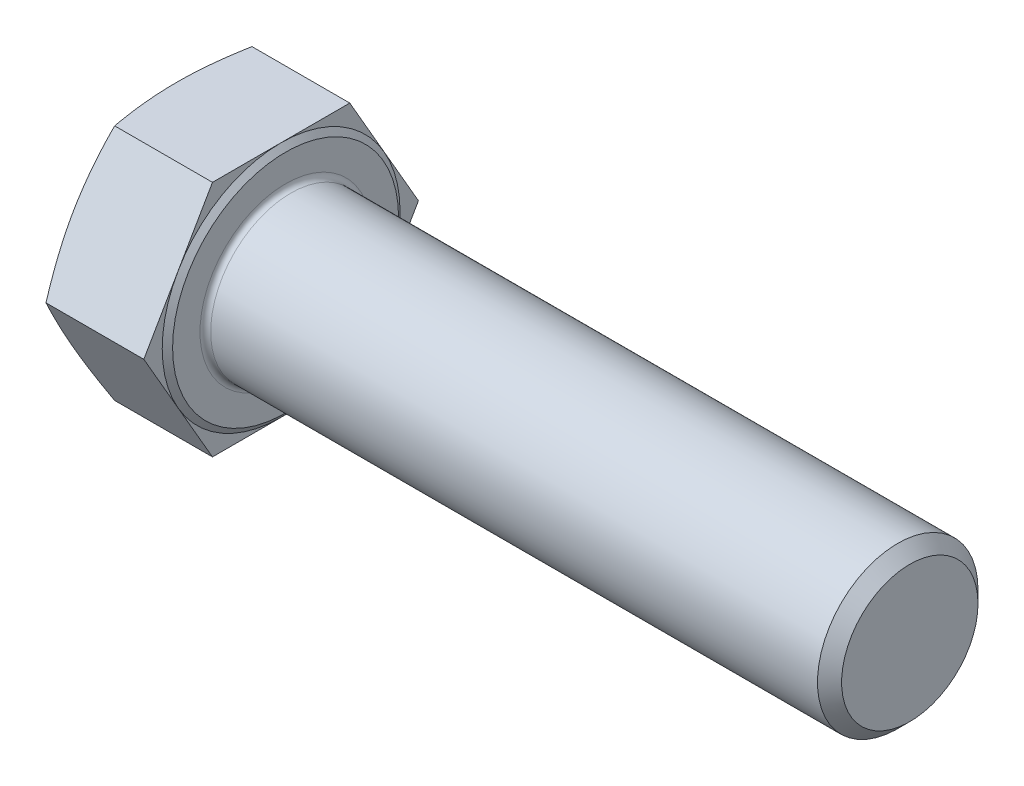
ISO-10303-21;
HEADER;
FILE_DESCRIPTION(('STEP AP214'),'2;1');
FILE_NAME('part.step','',(''),(''),'','','');
FILE_SCHEMA(('AUTOMOTIVE_DESIGN { 1 0 10303 214 1 1 1 1 }'));
ENDSEC;
DATA;
#1=APPLICATION_CONTEXT('core data for automotive mechanical design processes');
#2=APPLICATION_PROTOCOL_DEFINITION('international standard','automotive_design',2000,#1);
#3=PRODUCT_CONTEXT('',#1,'mechanical');
#4=PRODUCT('Part','Part','',(#3));
#5=PRODUCT_RELATED_PRODUCT_CATEGORY('part','',(#4));
#6=PRODUCT_DEFINITION_FORMATION('','',#4);
#7=PRODUCT_DEFINITION_CONTEXT('part definition',#1,'design');
#8=PRODUCT_DEFINITION('design','',#6,#7);
#9=PRODUCT_DEFINITION_SHAPE('','',#8);
#10=(LENGTH_UNIT() NAMED_UNIT(*) SI_UNIT(.MILLI.,.METRE.));
#11=(NAMED_UNIT(*) PLANE_ANGLE_UNIT() SI_UNIT($,.RADIAN.));
#12=(NAMED_UNIT(*) SI_UNIT($,.STERADIAN.) SOLID_ANGLE_UNIT());
#13=UNCERTAINTY_MEASURE_WITH_UNIT(LENGTH_MEASURE(1.E-05),#10,'distance_accuracy_value','');
#14=(GEOMETRIC_REPRESENTATION_CONTEXT(3) GLOBAL_UNCERTAINTY_ASSIGNED_CONTEXT((#13)) GLOBAL_UNIT_ASSIGNED_CONTEXT((#10,
#11,#12)) REPRESENTATION_CONTEXT('',''));
#15=CARTESIAN_POINT('',(0.,0.,0.));
#16=DIRECTION('',(0.,0.,1.));
#17=DIRECTION('',(1.,0.,0.));
#18=AXIS2_PLACEMENT_3D('',#15,#16,#17);
#19=CARTESIAN_POINT('',(12.22,0.,0.));
#20=DIRECTION('',(1.,0.,0.));
#21=DIRECTION('',(0.,0.,-1.));
#22=AXIS2_PLACEMENT_3D('',#19,#20,#21);
#23=PLANE('',#22);
#24=CARTESIAN_POINT('',(12.22,0.,0.));
#25=DIRECTION('',(1.,0.,0.));
#26=DIRECTION('',(0.,0.,-1.));
#27=AXIS2_PLACEMENT_3D('',#24,#25,#26);
#28=CIRCLE('',#27,9.6);
#29=CARTESIAN_POINT('',(12.22,0.,-9.6));
#30=VERTEX_POINT('',#29);
#31=EDGE_CURVE('E188',#30,#30,#28,.F.);
#32=ORIENTED_EDGE('',*,*,#31,.T.);
#33=EDGE_LOOP('',(#32));
#34=FACE_BOUND('',#33,.T.);
#35=CARTESIAN_POINT('',(12.22,0.,0.));
#36=DIRECTION('',(-1.,0.,0.));
#37=DIRECTION('',(0.,0.,1.));
#38=AXIS2_PLACEMENT_3D('',#35,#36,#37);
#39=CIRCLE('',#38,12.67);
#40=CARTESIAN_POINT('',(12.22,0.,12.67));
#41=VERTEX_POINT('',#40);
#42=EDGE_CURVE('E139',#41,#41,#39,.T.);
#43=ORIENTED_EDGE('',*,*,#42,.F.);
#44=EDGE_LOOP('',(#43));
#45=FACE_BOUND('',#44,.T.);
#46=ADVANCED_FACE('F33',(#34,#45),#23,.T.);
#47=CARTESIAN_POINT('',(11.72,13.335,-23.096897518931));
#48=DIRECTION('',(1.,0.,0.));
#49=DIRECTION('',(0.,0.,-1.));
#50=AXIS2_PLACEMENT_3D('',#47,#48,#49);
#51=PLANE('',#50);
#52=DIRECTION('',(0.,-0.866025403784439,0.5));
#53=VECTOR('',#52,1.);
#54=CARTESIAN_POINT('',(11.72,13.335,7.69896583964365));
#55=LINE('',#54,#53);
#56=CARTESIAN_POINT('',(11.72,13.335,7.69896583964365));
#57=VERTEX_POINT('',#56);
#58=CARTESIAN_POINT('',(11.72,6.6675,11.5484487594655));
#59=VERTEX_POINT('',#58);
#60=EDGE_CURVE('E138',#57,#59,#55,.T.);
#61=ORIENTED_EDGE('',*,*,#60,.T.);
#62=CARTESIAN_POINT('',(11.72,0.,0.));
#63=DIRECTION('',(-1.,0.,0.));
#64=DIRECTION('',(0.,0.,1.));
#65=AXIS2_PLACEMENT_3D('',#62,#63,#64);
#66=CIRCLE('',#65,13.335);
#67=CARTESIAN_POINT('',(11.72,13.335,0.));
#68=VERTEX_POINT('',#67);
#69=EDGE_CURVE('E49',#59,#68,#66,.T.);
#70=ORIENTED_EDGE('',*,*,#69,.T.);
#71=DIRECTION('',(0.,0.,1.));
#72=VECTOR('',#71,1.);
#73=CARTESIAN_POINT('',(11.72,13.335,-7.69896583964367));
#74=LINE('',#73,#72);
#75=EDGE_CURVE('E135',#68,#57,#74,.T.);
#76=ORIENTED_EDGE('',*,*,#75,.T.);
#77=EDGE_LOOP('',(#61,#70,#76));
#78=FACE_BOUND('',#77,.T.);
#79=ADVANCED_FACE('F134',(#78),#51,.T.);
#80=CARTESIAN_POINT('',(11.72,13.335,-7.69896583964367));
#81=VERTEX_POINT('',#80);
#82=EDGE_CURVE('E145',#81,#68,#74,.T.);
#83=ORIENTED_EDGE('',*,*,#82,.T.);
#84=CARTESIAN_POINT('',(11.72,6.6675,-11.5484487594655));
#85=VERTEX_POINT('',#84);
#86=EDGE_CURVE('E122',#68,#85,#66,.T.);
#87=ORIENTED_EDGE('',*,*,#86,.T.);
#88=DIRECTION('',(0.,0.866025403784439,0.5));
#89=VECTOR('',#88,1.);
#90=CARTESIAN_POINT('',(11.72,0.,-15.3979316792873));
#91=LINE('',#90,#89);
#92=EDGE_CURVE('E151',#85,#81,#91,.T.);
#93=ORIENTED_EDGE('',*,*,#92,.T.);
#94=EDGE_LOOP('',(#83,#87,#93));
#95=FACE_BOUND('',#94,.T.);
#96=ADVANCED_FACE('F150',(#95),#51,.T.);
#97=CARTESIAN_POINT('',(11.72,0.,-15.3979316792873));
#98=VERTEX_POINT('',#97);
#99=EDGE_CURVE('E148',#98,#85,#91,.T.);
#100=ORIENTED_EDGE('',*,*,#99,.T.);
#101=CARTESIAN_POINT('',(11.72,-6.6675,-11.5484487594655));
#102=VERTEX_POINT('',#101);
#103=EDGE_CURVE('E125',#85,#102,#66,.T.);
#104=ORIENTED_EDGE('',*,*,#103,.T.);
#105=DIRECTION('',(0.,0.866025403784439,-0.5));
#106=VECTOR('',#105,1.);
#107=CARTESIAN_POINT('',(11.72,-13.335,-7.69896583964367));
#108=LINE('',#107,#106);
#109=EDGE_CURVE('E306',#102,#98,#108,.T.);
#110=ORIENTED_EDGE('',*,*,#109,.T.);
#111=EDGE_LOOP('',(#100,#104,#110));
#112=FACE_BOUND('',#111,.T.);
#113=ADVANCED_FACE('F337',(#112),#51,.T.);
#114=CARTESIAN_POINT('',(11.72,-13.335,-7.69896583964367));
#115=VERTEX_POINT('',#114);
#116=EDGE_CURVE('E304',#115,#102,#108,.T.);
#117=ORIENTED_EDGE('',*,*,#116,.T.);
#118=CARTESIAN_POINT('',(11.72,-13.335,0.));
#119=VERTEX_POINT('',#118);
#120=EDGE_CURVE('E338',#102,#119,#66,.T.);
#121=ORIENTED_EDGE('',*,*,#120,.T.);
#122=DIRECTION('',(0.,0.,-1.));
#123=VECTOR('',#122,1.);
#124=CARTESIAN_POINT('',(11.72,-13.335,7.69896583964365));
#125=LINE('',#124,#123);
#126=EDGE_CURVE('E162',#119,#115,#125,.T.);
#127=ORIENTED_EDGE('',*,*,#126,.T.);
#128=EDGE_LOOP('',(#117,#121,#127));
#129=FACE_BOUND('',#128,.T.);
#130=ADVANCED_FACE('F352',(#129),#51,.T.);
#131=CARTESIAN_POINT('',(11.72,-13.335,7.69896583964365));
#132=VERTEX_POINT('',#131);
#133=EDGE_CURVE('E163',#132,#119,#125,.T.);
#134=ORIENTED_EDGE('',*,*,#133,.T.);
#135=CARTESIAN_POINT('',(11.72,-6.6675,11.5484487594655));
#136=VERTEX_POINT('',#135);
#137=EDGE_CURVE('E339',#119,#136,#66,.T.);
#138=ORIENTED_EDGE('',*,*,#137,.T.);
#139=DIRECTION('',(0.,-0.866025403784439,-0.5));
#140=VECTOR('',#139,1.);
#141=CARTESIAN_POINT('',(11.72,0.,15.3979316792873));
#142=LINE('',#141,#140);
#143=EDGE_CURVE('E158',#136,#132,#142,.T.);
#144=ORIENTED_EDGE('',*,*,#143,.T.);
#145=EDGE_LOOP('',(#134,#138,#144));
#146=FACE_BOUND('',#145,.T.);
#147=ADVANCED_FACE('F347',(#146),#51,.T.);
#148=CARTESIAN_POINT('',(11.72,0.,15.3979316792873));
#149=VERTEX_POINT('',#148);
#150=EDGE_CURVE('E159',#149,#136,#142,.T.);
#151=ORIENTED_EDGE('',*,*,#150,.T.);
#152=EDGE_CURVE('E140',#136,#59,#66,.T.);
#153=ORIENTED_EDGE('',*,*,#152,.T.);
#154=EDGE_CURVE('E153',#59,#149,#55,.T.);
#155=ORIENTED_EDGE('',*,*,#154,.T.);
#156=EDGE_LOOP('',(#151,#153,#155));
#157=FACE_BOUND('',#156,.T.);
#158=ADVANCED_FACE('F213',(#157),#51,.T.);
#159=CARTESIAN_POINT('',(11.72,-13.335,-7.69896583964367));
#160=DIRECTION('',(0.,0.5,0.866025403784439));
#161=DIRECTION('',(0.,-0.866025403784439,0.5));
#162=AXIS2_PLACEMENT_3D('',#159,#160,#161);
#163=PLANE('',#162);
#164=CARTESIAN_POINT('',(0.750887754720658,0.00020000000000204,-15.3980471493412));
#165=CARTESIAN_POINT('',(0.634798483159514,-0.552048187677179,-15.0792065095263));
#166=CARTESIAN_POINT('',(0.529195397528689,-1.1061173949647,-14.7593145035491));
#167=CARTESIAN_POINT('',(0.343403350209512,-2.21785825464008,-14.1174506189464));
#168=CARTESIAN_POINT('',(0.263234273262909,-2.77553237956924,-13.7954773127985));
#169=CARTESIAN_POINT('',(0.133563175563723,-3.88829447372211,-13.1530238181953));
#170=CARTESIAN_POINT('',(0.0837783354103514,-4.44335703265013,-12.8325583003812));
#171=CARTESIAN_POINT('',(0.0170028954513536,-5.55478010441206,-12.1908778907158));
#172=CARTESIAN_POINT('',(0.,-6.11114005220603,-11.8696633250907));
#173=CARTESIAN_POINT('',(0.,-7.22385994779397,-11.2272341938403));
#174=CARTESIAN_POINT('',(0.0170028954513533,-7.78021989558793,-10.9060196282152));
#175=CARTESIAN_POINT('',(0.0837783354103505,-8.89164296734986,-10.2643392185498));
#176=CARTESIAN_POINT('',(0.133563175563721,-9.44670552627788,-9.94387370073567));
#177=CARTESIAN_POINT('',(0.263234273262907,-10.5594676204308,-9.3014202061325));
#178=CARTESIAN_POINT('',(0.34340335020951,-11.1171417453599,-8.97944689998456));
#179=CARTESIAN_POINT('',(0.529195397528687,-12.2288826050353,-8.33758301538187));
#180=CARTESIAN_POINT('',(0.634798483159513,-12.7829518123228,-8.01769100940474));
#181=CARTESIAN_POINT('',(0.750887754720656,-13.3352,-7.69885036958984));
#182=B_SPLINE_CURVE_WITH_KNOTS('',3,(#164,#165,#166,#167,#168,#169,#170,#171,#172,#173,#174,
#175,#176,#177,#178,#179,#180,#181),.UNSPECIFIED.,.F.,.F.,(4,2,2,2,2,2,2,2,4),(0.,
1.94468691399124,3.8908904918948,5.81869076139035,7.7457678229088,9.67284488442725,
11.6006451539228,13.5468487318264,15.4915356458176),.UNSPECIFIED.);
#183=CARTESIAN_POINT('',(0.750845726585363,0.,-15.3979316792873));
#184=VERTEX_POINT('',#183);
#185=CARTESIAN_POINT('',(0.,-6.6675,-11.5484487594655));
#186=VERTEX_POINT('',#185);
#187=EDGE_CURVE('E321',#184,#186,#182,.T.);
#188=ORIENTED_EDGE('',*,*,#187,.F.);
#189=DIRECTION('',(-1.,0.,0.));
#190=VECTOR('',#189,1.);
#191=CARTESIAN_POINT('',(11.72,0.,-15.3979316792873));
#192=LINE('',#191,#190);
#193=EDGE_CURVE('E178',#98,#184,#192,.T.);
#194=ORIENTED_EDGE('',*,*,#193,.F.);
#195=ORIENTED_EDGE('',*,*,#109,.F.);
#196=ORIENTED_EDGE('',*,*,#116,.F.);
#197=DIRECTION('',(-1.,0.,0.));
#198=VECTOR('',#197,1.);
#199=CARTESIAN_POINT('',(11.72,-13.335,-7.69896583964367));
#200=LINE('',#199,#198);
#201=CARTESIAN_POINT('',(0.750845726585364,-13.335,-7.69896583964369));
#202=VERTEX_POINT('',#201);
#203=EDGE_CURVE('E166',#115,#202,#200,.T.);
#204=ORIENTED_EDGE('',*,*,#203,.T.);
#205=EDGE_CURVE('E246',#186,#202,#182,.T.);
#206=ORIENTED_EDGE('',*,*,#205,.F.);
#207=EDGE_LOOP('',(#188,#194,#195,#196,#204,#206));
#208=FACE_BOUND('',#207,.T.);
#209=ADVANCED_FACE('F35',(#208),#163,.F.);
#210=CARTESIAN_POINT('',(11.72,0.,-15.3979316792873));
#211=DIRECTION('',(0.,-0.5,0.866025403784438));
#212=DIRECTION('',(0.,-0.866025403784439,-0.5));
#213=AXIS2_PLACEMENT_3D('',#210,#211,#212);
#214=PLANE('',#213);
#215=CARTESIAN_POINT('',(0.750887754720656,13.3352,-7.69885036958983));
#216=CARTESIAN_POINT('',(0.634798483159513,12.7829518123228,-8.01769100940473));
#217=CARTESIAN_POINT('',(0.529195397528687,12.2288826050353,-8.33758301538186));
#218=CARTESIAN_POINT('',(0.34340335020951,11.1171417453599,-8.97944689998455));
#219=CARTESIAN_POINT('',(0.263234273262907,10.5594676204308,-9.30142020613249));
#220=CARTESIAN_POINT('',(0.133563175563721,9.44670552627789,-9.94387370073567));
#221=CARTESIAN_POINT('',(0.0837783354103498,8.89164296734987,-10.2643392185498));
#222=CARTESIAN_POINT('',(0.0170028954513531,7.78021989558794,-10.9060196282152));
#223=CARTESIAN_POINT('',(0.,7.22385994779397,-11.2272341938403));
#224=CARTESIAN_POINT('',(0.,6.11114005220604,-11.8696633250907));
#225=CARTESIAN_POINT('',(0.0170028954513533,5.55478010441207,-12.1908778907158));
#226=CARTESIAN_POINT('',(0.0837783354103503,4.44335703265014,-12.8325583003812));
#227=CARTESIAN_POINT('',(0.133563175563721,3.88829447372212,-13.1530238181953));
#228=CARTESIAN_POINT('',(0.263234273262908,2.77553237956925,-13.7954773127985));
#229=CARTESIAN_POINT('',(0.343403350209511,2.21785825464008,-14.1174506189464));
#230=CARTESIAN_POINT('',(0.529195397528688,1.1061173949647,-14.7593145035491));
#231=CARTESIAN_POINT('',(0.634798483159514,0.552048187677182,-15.0792065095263));
#232=CARTESIAN_POINT('',(0.750887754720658,-0.000199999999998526,-15.3980471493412));
#233=B_SPLINE_CURVE_WITH_KNOTS('',3,(#215,#216,#217,#218,#219,#220,#221,#222,#223,#224,#225,
#226,#227,#228,#229,#230,#231,#232),.UNSPECIFIED.,.F.,.F.,(4,2,2,2,2,2,2,2,4),(0.,
1.94468691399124,3.89089049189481,5.81869076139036,7.7457678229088,9.67284488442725,
11.6006451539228,13.5468487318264,15.4915356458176),.UNSPECIFIED.);
#234=CARTESIAN_POINT('',(0.750845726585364,13.335,-7.69896583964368));
#235=VERTEX_POINT('',#234);
#236=CARTESIAN_POINT('',(0.,6.6675,-11.5484487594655));
#237=VERTEX_POINT('',#236);
#238=EDGE_CURVE('E261',#235,#237,#233,.T.);
#239=ORIENTED_EDGE('',*,*,#238,.F.);
#240=DIRECTION('',(-1.,0.,0.));
#241=VECTOR('',#240,1.);
#242=CARTESIAN_POINT('',(11.72,13.335,-7.69896583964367));
#243=LINE('',#242,#241);
#244=EDGE_CURVE('E176',#81,#235,#243,.T.);
#245=ORIENTED_EDGE('',*,*,#244,.F.);
#246=ORIENTED_EDGE('',*,*,#92,.F.);
#247=ORIENTED_EDGE('',*,*,#99,.F.);
#248=ORIENTED_EDGE('',*,*,#193,.T.);
#249=EDGE_CURVE('E257',#237,#184,#233,.T.);
#250=ORIENTED_EDGE('',*,*,#249,.F.);
#251=EDGE_LOOP('',(#239,#245,#246,#247,#248,#250));
#252=FACE_BOUND('',#251,.T.);
#253=ADVANCED_FACE('F267',(#252),#214,.F.);
#254=CARTESIAN_POINT('',(11.72,13.335,-7.69896583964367));
#255=DIRECTION('',(0.,-1.,0.));
#256=DIRECTION('',(0.,0.,-1.));
#257=AXIS2_PLACEMENT_3D('',#254,#255,#256);
#258=PLANE('',#257);
#259=CARTESIAN_POINT('',(4.01222179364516,13.335,-20.3841544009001));
#260=CARTESIAN_POINT('',(3.92034343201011,13.335,-20.082497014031));
#261=CARTESIAN_POINT('',(3.82902070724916,13.335,-19.7806704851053));
#262=CARTESIAN_POINT('',(3.64761092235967,13.335,-19.1766444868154));
#263=CARTESIAN_POINT('',(3.5575238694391,13.335,-18.874445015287));
#264=CARTESIAN_POINT('',(3.28929118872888,13.335,-17.9671957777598));
#265=CARTESIAN_POINT('',(3.11318765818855,13.335,-17.3615397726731));
#266=CARTESIAN_POINT('',(2.76735825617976,13.335,-16.1471832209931));
#267=CARTESIAN_POINT('',(2.59764489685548,13.335,-15.5384791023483));
#268=CARTESIAN_POINT('',(2.26656818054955,13.335,-14.3188068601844));
#269=CARTESIAN_POINT('',(2.10520467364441,13.335,-13.7078387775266));
#270=CARTESIAN_POINT('',(1.79482555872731,13.335,-12.4907808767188));
#271=CARTESIAN_POINT('',(1.64568223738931,13.335,-11.8847237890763));
#272=CARTESIAN_POINT('',(1.36009315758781,13.335,-10.6695938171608));
#273=CARTESIAN_POINT('',(1.22364761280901,13.335,-10.0605208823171));
#274=CARTESIAN_POINT('',(0.966635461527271,13.335,-8.83922290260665));
#275=CARTESIAN_POINT('',(0.846063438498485,13.335,-8.22699900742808));
#276=CARTESIAN_POINT('',(0.62446963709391,13.335,-6.99899683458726));
#277=CARTESIAN_POINT('',(0.52344720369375,13.335,-6.38321867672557));
#278=CARTESIAN_POINT('',(0.355059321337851,13.335,-5.21744701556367));
#279=CARTESIAN_POINT('',(0.285190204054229,13.335,-4.66781855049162));
#280=CARTESIAN_POINT('',(0.166918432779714,13.335,-3.56623751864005));
#281=CARTESIAN_POINT('',(0.118515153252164,13.335,-3.01428502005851));
#282=CARTESIAN_POINT('',(0.0455060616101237,13.335,-1.90917548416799));
#283=CARTESIAN_POINT('',(0.0208834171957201,13.335,-1.3560195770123));
#284=CARTESIAN_POINT('',(-0.00331776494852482,13.335,-0.249154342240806));
#285=CARTESIAN_POINT('',(-0.00289647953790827,13.335,0.304554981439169));
#286=CARTESIAN_POINT('',(0.0230328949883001,13.335,1.41418584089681));
#287=CARTESIAN_POINT('',(0.0486682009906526,13.335,1.97010435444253));
#288=CARTESIAN_POINT('',(0.123845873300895,13.335,3.08030851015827));
#289=CARTESIAN_POINT('',(0.173388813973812,13.335,3.63459411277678));
#290=CARTESIAN_POINT('',(0.294064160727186,13.335,4.7412587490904));
#291=CARTESIAN_POINT('',(0.365215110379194,13.335,5.29363573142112));
#292=CARTESIAN_POINT('',(0.5262203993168,13.335,6.39562628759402));
#293=CARTESIAN_POINT('',(0.616074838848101,13.335,6.94523984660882));
#294=CARTESIAN_POINT('',(0.816733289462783,13.335,8.07062526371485));
#295=CARTESIAN_POINT('',(0.928394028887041,13.335,8.6462430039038));
#296=CARTESIAN_POINT('',(1.16608690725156,13.335,9.79452255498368));
#297=CARTESIAN_POINT('',(1.29212012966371,13.335,10.3671841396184));
#298=CARTESIAN_POINT('',(1.55591153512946,13.335,11.5099594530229));
#299=CARTESIAN_POINT('',(1.69367312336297,13.335,12.0800723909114));
#300=CARTESIAN_POINT('',(1.97868028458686,13.335,13.2178966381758));
#301=CARTESIAN_POINT('',(2.12592563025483,13.335,13.7856080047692));
#302=CARTESIAN_POINT('',(2.42832162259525,13.335,14.9196948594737));
#303=CARTESIAN_POINT('',(2.5834821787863,13.335,15.4860676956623));
#304=CARTESIAN_POINT('',(2.90011507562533,13.335,16.6170438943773));
#305=CARTESIAN_POINT('',(3.06158744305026,13.335,17.1816472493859));
#306=CARTESIAN_POINT('',(3.38968862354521,13.335,18.3092476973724));
#307=CARTESIAN_POINT('',(3.5563165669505,13.335,18.8722450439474));
#308=CARTESIAN_POINT('',(3.89385918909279,13.335,19.9969497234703));
#309=CARTESIAN_POINT('',(4.06477385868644,13.335,20.558657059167));
#310=CARTESIAN_POINT('',(4.40826794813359,13.335,21.6747747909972));
#311=CARTESIAN_POINT('',(4.58080814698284,13.335,22.2291972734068));
#312=CARTESIAN_POINT('',(4.92883115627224,13.335,23.3371185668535));
#313=CARTESIAN_POINT('',(5.10431397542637,13.335,23.8906173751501));
#314=CARTESIAN_POINT('',(5.63449510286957,13.335,25.5499736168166));
#315=CARTESIAN_POINT('',(5.99291130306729,13.335,26.6546431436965));
#316=CARTESIAN_POINT('',(6.71559817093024,13.335,28.8574161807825));
#317=CARTESIAN_POINT('',(7.07984146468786,13.335,29.9555287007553));
#318=CARTESIAN_POINT('',(7.63025060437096,13.335,31.6012933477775));
#319=CARTESIAN_POINT('',(7.81438685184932,13.335,32.1496254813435));
#320=CARTESIAN_POINT('',(8.18385083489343,13.335,33.2458867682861));
#321=CARTESIAN_POINT('',(8.36917856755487,13.335,33.7938159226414));
#322=CARTESIAN_POINT('',(8.55502184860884,13.335,34.341570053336));
#323=B_SPLINE_CURVE_WITH_KNOTS('',3,(#259,#260,#261,#262,#263,#264,#265,#266,#267,#268,#269,
#270,#271,#272,#273,#274,#275,#276,#277,#278,#279,#280,#281,#282,#283,#284,#285,#286,#287,#288,
#289,#290,#291,#292,#293,#294,#295,#296,#297,#298,#299,#300,#301,#302,#303,#304,#305,#306,#307,
#308,#309,#310,#311,#312,#313,#314,#315,#316,#317,#318,#319,#320,#321,#322),.UNSPECIFIED.,.F.,
.F.,(4,2,2,2,2,2,2,2,2,2,2,2,2,2,2,2,2,2,2,2,2,2,2,2,2,2,2,2,2,2,2,4),(0.,0.946016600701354,
1.89203871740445,3.78422279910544,5.67993722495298,7.57561760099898,9.44792522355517,
11.3202643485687,13.1919629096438,15.0635987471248,16.7253885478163,18.387129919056,
20.0476942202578,21.7082467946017,23.3772208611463,25.0462350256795,26.7166855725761,
28.3871450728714,30.1459639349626,31.9049154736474,33.6643794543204,35.4238012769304,
37.1854826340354,38.9471714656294,40.7085647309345,42.4699542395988,44.2118945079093,
45.9538399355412,49.437880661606,52.9087017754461,54.6439725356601,56.3792390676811),.UNSPECIFIED.);
#324=CARTESIAN_POINT('',(0.750845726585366,13.335,7.69896583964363));
#325=VERTEX_POINT('',#324);
#326=CARTESIAN_POINT('',(0.,13.335,0.));
#327=VERTEX_POINT('',#326);
#328=EDGE_CURVE('E57',#325,#327,#323,.F.);
#329=ORIENTED_EDGE('',*,*,#328,.F.);
#330=DIRECTION('',(-1.,0.,0.));
#331=VECTOR('',#330,1.);
#332=CARTESIAN_POINT('',(11.72,13.335,7.69896583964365));
#333=LINE('',#332,#331);
#334=EDGE_CURVE('E147',#57,#325,#333,.T.);
#335=ORIENTED_EDGE('',*,*,#334,.F.);
#336=ORIENTED_EDGE('',*,*,#75,.F.);
#337=ORIENTED_EDGE('',*,*,#82,.F.);
#338=ORIENTED_EDGE('',*,*,#244,.T.);
#339=EDGE_CURVE('E262',#327,#235,#323,.F.);
#340=ORIENTED_EDGE('',*,*,#339,.F.);
#341=EDGE_LOOP('',(#329,#335,#336,#337,#338,#340));
#342=FACE_BOUND('',#341,.T.);
#343=ADVANCED_FACE('F143',(#342),#258,.F.);
#344=CARTESIAN_POINT('',(11.72,13.335,7.69896583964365));
#345=DIRECTION('',(0.,-0.5,-0.866025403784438));
#346=DIRECTION('',(0.,0.866025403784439,-0.5));
#347=AXIS2_PLACEMENT_3D('',#344,#345,#346);
#348=PLANE('',#347);
#349=CARTESIAN_POINT('',(0.750887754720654,-0.000199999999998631,15.3980471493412));
#350=CARTESIAN_POINT('',(0.63479848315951,0.552048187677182,15.0792065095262));
#351=CARTESIAN_POINT('',(0.529195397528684,1.1061173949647,14.7593145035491));
#352=CARTESIAN_POINT('',(0.343403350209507,2.21785825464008,14.1174506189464));
#353=CARTESIAN_POINT('',(0.263234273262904,2.77553237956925,13.7954773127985));
#354=CARTESIAN_POINT('',(0.133563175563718,3.88829447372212,13.1530238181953));
#355=CARTESIAN_POINT('',(0.0837783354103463,4.44335703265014,12.8325583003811));
#356=CARTESIAN_POINT('',(0.017002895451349,5.55478010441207,12.1908778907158));
#357=CARTESIAN_POINT('',(0.,6.11114005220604,11.8696633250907));
#358=CARTESIAN_POINT('',(0.,7.22385994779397,11.2272341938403));
#359=CARTESIAN_POINT('',(0.017002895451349,7.78021989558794,10.9060196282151));
#360=CARTESIAN_POINT('',(0.0837783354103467,8.89164296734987,10.2643392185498));
#361=CARTESIAN_POINT('',(0.133563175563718,9.44670552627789,9.94387370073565));
#362=CARTESIAN_POINT('',(0.263234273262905,10.5594676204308,9.30142020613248));
#363=CARTESIAN_POINT('',(0.343403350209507,11.1171417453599,8.97944689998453));
#364=CARTESIAN_POINT('',(0.529195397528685,12.2288826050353,8.33758301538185));
#365=CARTESIAN_POINT('',(0.634798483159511,12.7829518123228,8.01769100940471));
#366=CARTESIAN_POINT('',(0.750887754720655,13.3352,7.69885036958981));
#367=B_SPLINE_CURVE_WITH_KNOTS('',3,(#349,#350,#351,#352,#353,#354,#355,#356,#357,#358,#359,
#360,#361,#362,#363,#364,#365,#366),.UNSPECIFIED.,.F.,.F.,(4,2,2,2,2,2,2,2,4),(0.,
1.94468691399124,3.89089049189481,5.81869076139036,7.7457678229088,9.67284488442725,
11.6006451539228,13.5468487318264,15.4915356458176),.UNSPECIFIED.);
#368=CARTESIAN_POINT('',(0.750845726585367,0.,15.3979316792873));
#369=VERTEX_POINT('',#368);
#370=CARTESIAN_POINT('',(0.,6.6675,11.5484487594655));
#371=VERTEX_POINT('',#370);
#372=EDGE_CURVE('E251',#369,#371,#367,.T.);
#373=ORIENTED_EDGE('',*,*,#372,.F.);
#374=DIRECTION('',(-1.,0.,0.));
#375=VECTOR('',#374,1.);
#376=CARTESIAN_POINT('',(11.72,0.,15.3979316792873));
#377=LINE('',#376,#375);
#378=EDGE_CURVE('E172',#149,#369,#377,.T.);
#379=ORIENTED_EDGE('',*,*,#378,.F.);
#380=ORIENTED_EDGE('',*,*,#154,.F.);
#381=ORIENTED_EDGE('',*,*,#60,.F.);
#382=ORIENTED_EDGE('',*,*,#334,.T.);
#383=EDGE_CURVE('E312',#371,#325,#367,.T.);
#384=ORIENTED_EDGE('',*,*,#383,.F.);
#385=EDGE_LOOP('',(#373,#379,#380,#381,#382,#384));
#386=FACE_BOUND('',#385,.T.);
#387=ADVANCED_FACE('F273',(#386),#348,.F.);
#388=CARTESIAN_POINT('',(11.72,0.,15.3979316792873));
#389=DIRECTION('',(0.,0.5,-0.866025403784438));
#390=DIRECTION('',(0.,0.866025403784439,0.5));
#391=AXIS2_PLACEMENT_3D('',#388,#389,#390);
#392=PLANE('',#391);
#393=CARTESIAN_POINT('',(0.750887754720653,-13.3352,7.69885036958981));
#394=CARTESIAN_POINT('',(0.634798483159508,-12.7829518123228,8.01769100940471));
#395=CARTESIAN_POINT('',(0.529195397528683,-12.2288826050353,8.33758301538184));
#396=CARTESIAN_POINT('',(0.343403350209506,-11.1171417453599,8.97944689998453));
#397=CARTESIAN_POINT('',(0.263234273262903,-10.5594676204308,9.30142020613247));
#398=CARTESIAN_POINT('',(0.133563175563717,-9.44670552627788,9.94387370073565));
#399=CARTESIAN_POINT('',(0.0837783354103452,-8.89164296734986,10.2643392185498));
#400=CARTESIAN_POINT('',(0.0170028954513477,-7.78021989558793,10.9060196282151));
#401=CARTESIAN_POINT('',(0.,-7.22385994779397,11.2272341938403));
#402=CARTESIAN_POINT('',(0.,-6.11114005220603,11.8696633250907));
#403=CARTESIAN_POINT('',(0.0170028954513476,-5.55478010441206,12.1908778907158));
#404=CARTESIAN_POINT('',(0.0837783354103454,-4.44335703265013,12.8325583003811));
#405=CARTESIAN_POINT('',(0.133563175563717,-3.88829447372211,13.1530238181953));
#406=CARTESIAN_POINT('',(0.263234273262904,-2.77553237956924,13.7954773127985));
#407=CARTESIAN_POINT('',(0.343403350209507,-2.21785825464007,14.1174506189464));
#408=CARTESIAN_POINT('',(0.529195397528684,-1.10611739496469,14.7593145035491));
#409=CARTESIAN_POINT('',(0.63479848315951,-0.552048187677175,15.0792065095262));
#410=CARTESIAN_POINT('',(0.750887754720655,0.000200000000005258,15.3980471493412));
#411=B_SPLINE_CURVE_WITH_KNOTS('',3,(#393,#394,#395,#396,#397,#398,#399,#400,#401,#402,#403,
#404,#405,#406,#407,#408,#409,#410),.UNSPECIFIED.,.F.,.F.,(4,2,2,2,2,2,2,2,4),(0.,
1.94468691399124,3.89089049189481,5.81869076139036,7.74576782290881,9.67284488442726,
11.6006451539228,13.5468487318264,15.4915356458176),.UNSPECIFIED.);
#412=CARTESIAN_POINT('',(0.750845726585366,-13.335,7.69896583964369));
#413=VERTEX_POINT('',#412);
#414=CARTESIAN_POINT('',(0.,-6.6675,11.5484487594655));
#415=VERTEX_POINT('',#414);
#416=EDGE_CURVE('E239',#413,#415,#411,.T.);
#417=ORIENTED_EDGE('',*,*,#416,.F.);
#418=DIRECTION('',(-1.,0.,0.));
#419=VECTOR('',#418,1.);
#420=CARTESIAN_POINT('',(11.72,-13.335,7.69896583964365));
#421=LINE('',#420,#419);
#422=EDGE_CURVE('E169',#132,#413,#421,.T.);
#423=ORIENTED_EDGE('',*,*,#422,.F.);
#424=ORIENTED_EDGE('',*,*,#143,.F.);
#425=ORIENTED_EDGE('',*,*,#150,.F.);
#426=ORIENTED_EDGE('',*,*,#378,.T.);
#427=EDGE_CURVE('E317',#415,#369,#411,.T.);
#428=ORIENTED_EDGE('',*,*,#427,.F.);
#429=EDGE_LOOP('',(#417,#423,#424,#425,#426,#428));
#430=FACE_BOUND('',#429,.T.);
#431=ADVANCED_FACE('F276',(#430),#392,.F.);
#432=CARTESIAN_POINT('',(11.72,-13.335,7.69896583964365));
#433=DIRECTION('',(0.,1.,0.));
#434=DIRECTION('',(0.,0.,1.));
#435=AXIS2_PLACEMENT_3D('',#432,#433,#434);
#436=PLANE('',#435);
#437=CARTESIAN_POINT('',(4.01222179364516,-13.335,-20.3841544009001));
#438=CARTESIAN_POINT('',(3.92034343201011,-13.335,-20.082497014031));
#439=CARTESIAN_POINT('',(3.82902070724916,-13.335,-19.7806704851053));
#440=CARTESIAN_POINT('',(3.64761092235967,-13.335,-19.1766444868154));
#441=CARTESIAN_POINT('',(3.5575238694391,-13.335,-18.874445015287));
#442=CARTESIAN_POINT('',(3.28929118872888,-13.335,-17.9671957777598));
#443=CARTESIAN_POINT('',(3.11318765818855,-13.335,-17.3615397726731));
#444=CARTESIAN_POINT('',(2.76735825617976,-13.335,-16.1471832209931));
#445=CARTESIAN_POINT('',(2.59764489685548,-13.335,-15.5384791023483));
#446=CARTESIAN_POINT('',(2.26656818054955,-13.335,-14.3188068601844));
#447=CARTESIAN_POINT('',(2.10520467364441,-13.335,-13.7078387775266));
#448=CARTESIAN_POINT('',(1.79482555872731,-13.335,-12.4907808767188));
#449=CARTESIAN_POINT('',(1.64568223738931,-13.335,-11.8847237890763));
#450=CARTESIAN_POINT('',(1.3600931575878,-13.335,-10.6695938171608));
#451=CARTESIAN_POINT('',(1.223647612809,-13.335,-10.0605208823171));
#452=CARTESIAN_POINT('',(0.966635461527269,-13.335,-8.83922290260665));
#453=CARTESIAN_POINT('',(0.846063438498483,-13.335,-8.22699900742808));
#454=CARTESIAN_POINT('',(0.624469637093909,-13.335,-6.99899683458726));
#455=CARTESIAN_POINT('',(0.523447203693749,-13.335,-6.38321867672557));
#456=CARTESIAN_POINT('',(0.35505932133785,-13.335,-5.21744701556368));
#457=CARTESIAN_POINT('',(0.285190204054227,-13.335,-4.66781855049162));
#458=CARTESIAN_POINT('',(0.166918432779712,-13.335,-3.56623751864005));
#459=CARTESIAN_POINT('',(0.118515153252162,-13.335,-3.01428502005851));
#460=CARTESIAN_POINT('',(0.045506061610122,-13.335,-1.90917548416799));
#461=CARTESIAN_POINT('',(0.0208834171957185,-13.335,-1.3560195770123));
#462=CARTESIAN_POINT('',(-0.00331776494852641,-13.335,-0.249154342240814));
#463=CARTESIAN_POINT('',(-0.00289647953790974,-13.335,0.304554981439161));
#464=CARTESIAN_POINT('',(0.0230328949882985,-13.335,1.4141858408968));
#465=CARTESIAN_POINT('',(0.0486682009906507,-13.335,1.97010435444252));
#466=CARTESIAN_POINT('',(0.123845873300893,-13.335,3.08030851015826));
#467=CARTESIAN_POINT('',(0.17338881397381,-13.335,3.63459411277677));
#468=CARTESIAN_POINT('',(0.294064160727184,-13.335,4.74125874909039));
#469=CARTESIAN_POINT('',(0.365215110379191,-13.335,5.29363573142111));
#470=CARTESIAN_POINT('',(0.526220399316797,-13.335,6.39562628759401));
#471=CARTESIAN_POINT('',(0.616074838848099,-13.335,6.94523984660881));
#472=CARTESIAN_POINT('',(0.816733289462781,-13.335,8.07062526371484));
#473=CARTESIAN_POINT('',(0.928394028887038,-13.335,8.64624300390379));
#474=CARTESIAN_POINT('',(1.16608690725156,-13.335,9.79452255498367));
#475=CARTESIAN_POINT('',(1.29212012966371,-13.335,10.3671841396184));
#476=CARTESIAN_POINT('',(1.55591153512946,-13.335,11.5099594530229));
#477=CARTESIAN_POINT('',(1.69367312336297,-13.335,12.0800723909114));
#478=CARTESIAN_POINT('',(1.97868028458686,-13.335,13.2178966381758));
#479=CARTESIAN_POINT('',(2.12592563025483,-13.335,13.7856080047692));
#480=CARTESIAN_POINT('',(2.42832162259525,-13.335,14.9196948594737));
#481=CARTESIAN_POINT('',(2.5834821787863,-13.335,15.4860676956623));
#482=CARTESIAN_POINT('',(2.90011507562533,-13.335,16.6170438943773));
#483=CARTESIAN_POINT('',(3.06158744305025,-13.335,17.1816472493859));
#484=CARTESIAN_POINT('',(3.38968862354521,-13.335,18.3092476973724));
#485=CARTESIAN_POINT('',(3.55631656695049,-13.335,18.8722450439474));
#486=CARTESIAN_POINT('',(3.89385918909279,-13.335,19.9969497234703));
#487=CARTESIAN_POINT('',(4.06477385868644,-13.335,20.558657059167));
#488=CARTESIAN_POINT('',(4.40826794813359,-13.335,21.6747747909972));
#489=CARTESIAN_POINT('',(4.58080814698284,-13.335,22.2291972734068));
#490=CARTESIAN_POINT('',(4.92883115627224,-13.335,23.3371185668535));
#491=CARTESIAN_POINT('',(5.10431397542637,-13.335,23.8906173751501));
#492=CARTESIAN_POINT('',(5.63449510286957,-13.335,25.5499736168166));
#493=CARTESIAN_POINT('',(5.99291130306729,-13.335,26.6546431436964));
#494=CARTESIAN_POINT('',(6.71559817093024,-13.335,28.8574161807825));
#495=CARTESIAN_POINT('',(7.07984146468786,-13.335,29.9555287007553));
#496=CARTESIAN_POINT('',(7.63025060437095,-13.335,31.6012933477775));
#497=CARTESIAN_POINT('',(7.81438685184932,-13.335,32.1496254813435));
#498=CARTESIAN_POINT('',(8.18385083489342,-13.335,33.2458867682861));
#499=CARTESIAN_POINT('',(8.36917856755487,-13.335,33.7938159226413));
#500=CARTESIAN_POINT('',(8.55502184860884,-13.335,34.341570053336));
#501=B_SPLINE_CURVE_WITH_KNOTS('',3,(#437,#438,#439,#440,#441,#442,#443,#444,#445,#446,#447,
#448,#449,#450,#451,#452,#453,#454,#455,#456,#457,#458,#459,#460,#461,#462,#463,#464,#465,#466,
#467,#468,#469,#470,#471,#472,#473,#474,#475,#476,#477,#478,#479,#480,#481,#482,#483,#484,#485,
#486,#487,#488,#489,#490,#491,#492,#493,#494,#495,#496,#497,#498,#499,#500),.UNSPECIFIED.,.F.,
.F.,(4,2,2,2,2,2,2,2,2,2,2,2,2,2,2,2,2,2,2,2,2,2,2,2,2,2,2,2,2,2,2,4),(0.,0.946016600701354,
1.89203871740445,3.78422279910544,5.67993722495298,7.57561760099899,9.44792522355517,
11.3202643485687,13.1919629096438,15.0635987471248,16.7253885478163,18.387129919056,
20.0476942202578,21.7082467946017,23.3772208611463,25.0462350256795,26.7166855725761,
28.3871450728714,30.1459639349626,31.9049154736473,33.6643794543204,35.4238012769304,
37.1854826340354,38.9471714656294,40.7085647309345,42.4699542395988,44.2118945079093,
45.9538399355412,49.437880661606,52.9087017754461,54.6439725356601,56.3792390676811),.UNSPECIFIED.);
#502=CARTESIAN_POINT('',(0.,-13.335,0.));
#503=VERTEX_POINT('',#502);
#504=EDGE_CURVE('E295',#202,#503,#501,.T.);
#505=ORIENTED_EDGE('',*,*,#504,.F.);
#506=ORIENTED_EDGE('',*,*,#203,.F.);
#507=ORIENTED_EDGE('',*,*,#126,.F.);
#508=ORIENTED_EDGE('',*,*,#133,.F.);
#509=ORIENTED_EDGE('',*,*,#422,.T.);
#510=EDGE_CURVE('E229',#503,#413,#501,.T.);
#511=ORIENTED_EDGE('',*,*,#510,.F.);
#512=EDGE_LOOP('',(#505,#506,#507,#508,#509,#511));
#513=FACE_BOUND('',#512,.T.);
#514=ADVANCED_FACE('F280',(#513),#436,.F.);
#515=CARTESIAN_POINT('',(0.,0.,0.));
#516=DIRECTION('',(1.,0.,0.));
#517=DIRECTION('',(0.,0.,-1.));
#518=AXIS2_PLACEMENT_3D('',#515,#516,#517);
#519=CONICAL_SURFACE('',#518,13.335,1.22173047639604);
#520=ORIENTED_EDGE('',*,*,#249,.T.);
#521=ORIENTED_EDGE('',*,*,#187,.T.);
#522=CARTESIAN_POINT('',(0.,0.,0.));
#523=DIRECTION('',(1.,0.,0.));
#524=DIRECTION('',(0.,0.,-1.));
#525=AXIS2_PLACEMENT_3D('',#522,#523,#524);
#526=CIRCLE('',#525,13.335);
#527=EDGE_CURVE('E181',#186,#237,#526,.T.);
#528=ORIENTED_EDGE('',*,*,#527,.T.);
#529=EDGE_LOOP('',(#520,#521,#528));
#530=FACE_BOUND('',#529,.T.);
#531=ADVANCED_FACE('F284',(#530),#519,.T.);
#532=ORIENTED_EDGE('',*,*,#205,.T.);
#533=ORIENTED_EDGE('',*,*,#504,.T.);
#534=EDGE_CURVE('E184',#503,#186,#526,.T.);
#535=ORIENTED_EDGE('',*,*,#534,.T.);
#536=EDGE_LOOP('',(#532,#533,#535));
#537=FACE_BOUND('',#536,.T.);
#538=ADVANCED_FACE('F289',(#537),#519,.T.);
#539=ORIENTED_EDGE('',*,*,#416,.T.);
#540=EDGE_CURVE('E330',#415,#503,#526,.T.);
#541=ORIENTED_EDGE('',*,*,#540,.T.);
#542=ORIENTED_EDGE('',*,*,#510,.T.);
#543=EDGE_LOOP('',(#539,#541,#542));
#544=FACE_BOUND('',#543,.T.);
#545=ADVANCED_FACE('F224',(#544),#519,.T.);
#546=ORIENTED_EDGE('',*,*,#372,.T.);
#547=EDGE_CURVE('E336',#371,#415,#526,.T.);
#548=ORIENTED_EDGE('',*,*,#547,.T.);
#549=ORIENTED_EDGE('',*,*,#427,.T.);
#550=EDGE_LOOP('',(#546,#548,#549));
#551=FACE_BOUND('',#550,.T.);
#552=ADVANCED_FACE('F223',(#551),#519,.T.);
#553=ORIENTED_EDGE('',*,*,#328,.T.);
#554=CARTESIAN_POINT('',(0.,0.,0.));
#555=DIRECTION('',(-1.,0.,0.));
#556=DIRECTION('',(0.,0.,1.));
#557=AXIS2_PLACEMENT_3D('',#554,#555,#556);
#558=CIRCLE('',#557,13.335);
#559=EDGE_CURVE('E335',#371,#327,#558,.T.);
#560=ORIENTED_EDGE('',*,*,#559,.F.);
#561=ORIENTED_EDGE('',*,*,#383,.T.);
#562=EDGE_LOOP('',(#553,#560,#561));
#563=FACE_BOUND('',#562,.T.);
#564=ADVANCED_FACE('F218',(#563),#519,.T.);
#565=ORIENTED_EDGE('',*,*,#339,.T.);
#566=ORIENTED_EDGE('',*,*,#238,.T.);
#567=EDGE_CURVE('E185',#237,#327,#526,.T.);
#568=ORIENTED_EDGE('',*,*,#567,.T.);
#569=EDGE_LOOP('',(#565,#566,#568));
#570=FACE_BOUND('',#569,.T.);
#571=ADVANCED_FACE('F222',(#570),#519,.T.);
#572=CARTESIAN_POINT('',(0.,13.335,-23.096897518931));
#573=DIRECTION('',(1.,0.,0.));
#574=DIRECTION('',(0.,0.,-1.));
#575=AXIS2_PLACEMENT_3D('',#572,#573,#574);
#576=PLANE('',#575);
#577=ORIENTED_EDGE('',*,*,#567,.F.);
#578=ORIENTED_EDGE('',*,*,#527,.F.);
#579=ORIENTED_EDGE('',*,*,#534,.F.);
#580=ORIENTED_EDGE('',*,*,#540,.F.);
#581=ORIENTED_EDGE('',*,*,#547,.F.);
#582=ORIENTED_EDGE('',*,*,#559,.T.);
#583=EDGE_LOOP('',(#577,#578,#579,#580,#581,#582));
#584=FACE_BOUND('',#583,.T.);
#585=ADVANCED_FACE('F225',(#584),#576,.F.);
#586=CARTESIAN_POINT('',(11.72,0.,0.));
#587=DIRECTION('',(-1.,0.,0.));
#588=DIRECTION('',(0.,0.,1.));
#589=AXIS2_PLACEMENT_3D('',#586,#587,#588);
#590=CONICAL_SURFACE('',#589,13.335,0.926093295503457);
#591=ORIENTED_EDGE('',*,*,#42,.T.);
#592=EDGE_LOOP('',(#591));
#593=FACE_BOUND('',#592,.T.);
#594=ORIENTED_EDGE('',*,*,#69,.F.);
#595=ORIENTED_EDGE('',*,*,#152,.F.);
#596=ORIENTED_EDGE('',*,*,#137,.F.);
#597=ORIENTED_EDGE('',*,*,#120,.F.);
#598=ORIENTED_EDGE('',*,*,#103,.F.);
#599=ORIENTED_EDGE('',*,*,#86,.F.);
#600=EDGE_LOOP('',(#594,#595,#596,#597,#598,#599));
#601=FACE_BOUND('',#600,.T.);
#602=ADVANCED_FACE('F123',(#593,#601),#590,.T.);
#603=CARTESIAN_POINT('',(82.22,0.,0.));
#604=DIRECTION('',(-1.,0.,0.));
#605=DIRECTION('',(0.,0.,1.));
#606=AXIS2_PLACEMENT_3D('',#603,#604,#605);
#607=CYLINDRICAL_SURFACE('',#606,9.);
#608=CARTESIAN_POINT('',(80.867,0.,0.));
#609=DIRECTION('',(1.,0.,0.));
#610=DIRECTION('',(0.,0.,-1.));
#611=AXIS2_PLACEMENT_3D('',#608,#609,#610);
#612=CIRCLE('',#611,9.);
#613=CARTESIAN_POINT('',(80.867,0.,-9.00000000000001));
#614=VERTEX_POINT('',#613);
#615=EDGE_CURVE('E11',#614,#614,#612,.F.);
#616=ORIENTED_EDGE('',*,*,#615,.T.);
#617=EDGE_LOOP('',(#616));
#618=FACE_BOUND('',#617,.T.);
#619=CARTESIAN_POINT('',(12.82,0.,0.));
#620=DIRECTION('',(1.,0.,0.));
#621=DIRECTION('',(0.,0.,-1.));
#622=AXIS2_PLACEMENT_3D('',#619,#620,#621);
#623=CIRCLE('',#622,9.);
#624=CARTESIAN_POINT('',(12.82,0.,-9.));
#625=VERTEX_POINT('',#624);
#626=EDGE_CURVE('E129',#625,#625,#623,.T.);
#627=ORIENTED_EDGE('',*,*,#626,.T.);
#628=EDGE_LOOP('',(#627));
#629=FACE_BOUND('',#628,.T.);
#630=ADVANCED_FACE('F454',(#618,#629),#607,.T.);
#631=CARTESIAN_POINT('',(82.22,0.,0.));
#632=DIRECTION('',(1.,0.,0.));
#633=DIRECTION('',(0.,0.,-1.));
#634=AXIS2_PLACEMENT_3D('',#631,#632,#633);
#635=PLANE('',#634);
#636=CARTESIAN_POINT('',(82.22,0.,0.));
#637=DIRECTION('',(1.,0.,0.));
#638=DIRECTION('',(0.,0.,-1.));
#639=AXIS2_PLACEMENT_3D('',#636,#637,#638);
#640=CIRCLE('',#639,7.647);
#641=CARTESIAN_POINT('',(82.22,0.,-7.64700000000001));
#642=VERTEX_POINT('',#641);
#643=EDGE_CURVE('E42',#642,#642,#640,.T.);
#644=ORIENTED_EDGE('',*,*,#643,.T.);
#645=EDGE_LOOP('',(#644));
#646=FACE_BOUND('',#645,.T.);
#647=ADVANCED_FACE('F193',(#646),#635,.T.);
#648=CARTESIAN_POINT('',(12.82,0.,0.));
#649=DIRECTION('',(1.,0.,0.));
#650=DIRECTION('',(0.,0.,-1.));
#651=AXIS2_PLACEMENT_3D('',#648,#649,#650);
#652=TOROIDAL_SURFACE('',#651,9.6,0.6);
#653=ORIENTED_EDGE('',*,*,#31,.F.);
#654=EDGE_LOOP('',(#653));
#655=FACE_BOUND('',#654,.T.);
#656=ORIENTED_EDGE('',*,*,#626,.F.);
#657=EDGE_LOOP('',(#656));
#658=FACE_BOUND('',#657,.T.);
#659=ADVANCED_FACE('F197',(#655,#658),#652,.F.);
#660=CARTESIAN_POINT('',(82.22,0.,0.));
#661=DIRECTION('',(-1.,0.,0.));
#662=DIRECTION('',(0.,0.,1.));
#663=AXIS2_PLACEMENT_3D('',#660,#661,#662);
#664=CONICAL_SURFACE('',#663,7.647,0.785398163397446);
#665=ORIENTED_EDGE('',*,*,#615,.F.);
#666=EDGE_LOOP('',(#665));
#667=FACE_BOUND('',#666,.T.);
#668=ORIENTED_EDGE('',*,*,#643,.F.);
#669=EDGE_LOOP('',(#668));
#670=FACE_BOUND('',#669,.T.);
#671=ADVANCED_FACE('F195',(#667,#670),#664,.T.);
#672=CLOSED_SHELL('',(#46,#79,#96,#113,#130,#147,#158,#209,#253,#343,#387,#431,#514,#531,#538,
#545,#552,#564,#571,#585,#602,#630,#647,#659,#671));
#673=MANIFOLD_SOLID_BREP('B2',#672);
#674=ADVANCED_BREP_SHAPE_REPRESENTATION('',(#18,#673),#14);
#675=SHAPE_DEFINITION_REPRESENTATION(#9,#674);
ENDSEC;
END-ISO-10303-21;
